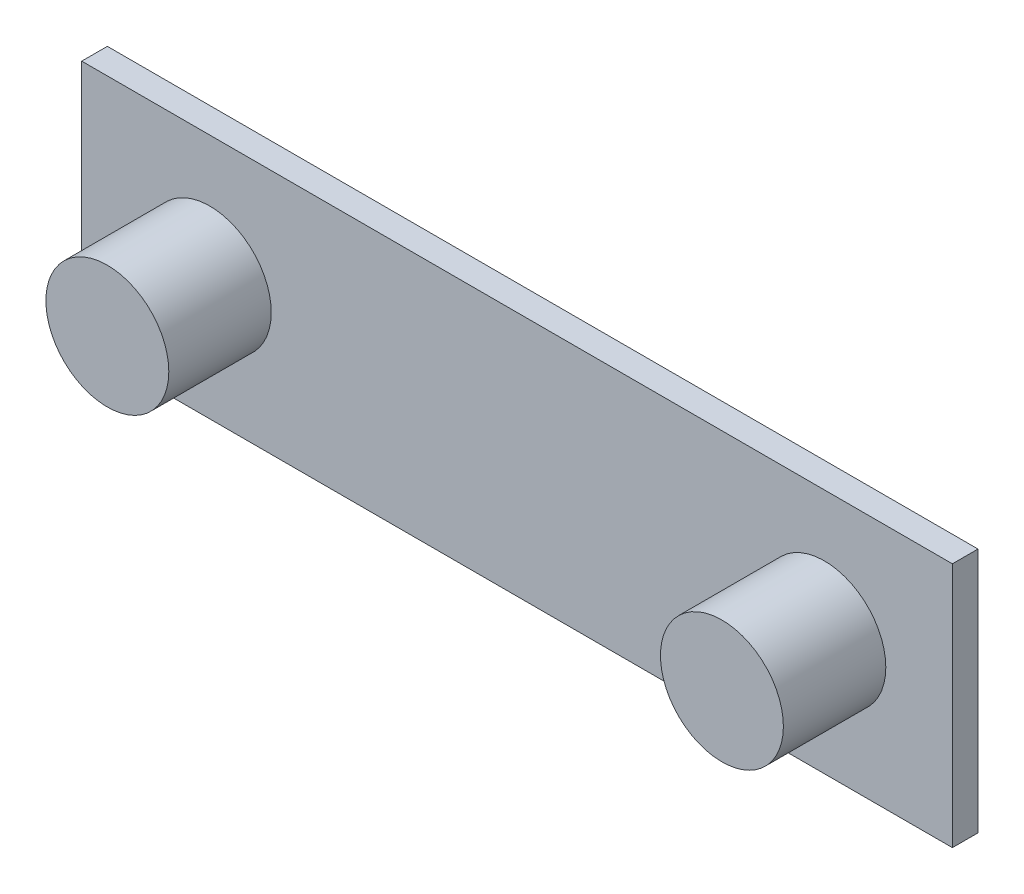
ISO-10303-21;
HEADER;
FILE_DESCRIPTION(('STEP AP214'),'2;1');
FILE_NAME('part.step','',(''),(''),'','','');
FILE_SCHEMA(('AUTOMOTIVE_DESIGN { 1 0 10303 214 1 1 1 1 }'));
ENDSEC;
DATA;
#1=APPLICATION_CONTEXT('core data for automotive mechanical design processes');
#2=APPLICATION_PROTOCOL_DEFINITION('international standard','automotive_design',2000,#1);
#3=PRODUCT_CONTEXT('',#1,'mechanical');
#4=PRODUCT('Part','Part','',(#3));
#5=PRODUCT_RELATED_PRODUCT_CATEGORY('part','',(#4));
#6=PRODUCT_DEFINITION_FORMATION('','',#4);
#7=PRODUCT_DEFINITION_CONTEXT('part definition',#1,'design');
#8=PRODUCT_DEFINITION('design','',#6,#7);
#9=PRODUCT_DEFINITION_SHAPE('','',#8);
#10=(LENGTH_UNIT() NAMED_UNIT(*) SI_UNIT(.MILLI.,.METRE.));
#11=(NAMED_UNIT(*) PLANE_ANGLE_UNIT() SI_UNIT($,.RADIAN.));
#12=(NAMED_UNIT(*) SI_UNIT($,.STERADIAN.) SOLID_ANGLE_UNIT());
#13=UNCERTAINTY_MEASURE_WITH_UNIT(LENGTH_MEASURE(1.E-05),#10,'distance_accuracy_value','');
#14=(GEOMETRIC_REPRESENTATION_CONTEXT(3) GLOBAL_UNCERTAINTY_ASSIGNED_CONTEXT((#13)) GLOBAL_UNIT_ASSIGNED_CONTEXT((#10,
#11,#12)) REPRESENTATION_CONTEXT('',''));
#15=CARTESIAN_POINT('',(0.,0.,0.));
#16=DIRECTION('',(0.,0.,1.));
#17=DIRECTION('',(1.,0.,0.));
#18=AXIS2_PLACEMENT_3D('',#15,#16,#17);
#19=CARTESIAN_POINT('',(0.,24.,2.5));
#20=DIRECTION('',(0.,1.,0.));
#21=DIRECTION('',(0.,0.,1.));
#22=AXIS2_PLACEMENT_3D('',#19,#20,#21);
#23=PLANE('',#22);
#24=DIRECTION('',(1.,0.,0.));
#25=VECTOR('',#24,1.);
#26=CARTESIAN_POINT('',(0.,24.,0.));
#27=LINE('',#26,#25);
#28=CARTESIAN_POINT('',(0.,24.,0.));
#29=VERTEX_POINT('',#28);
#30=CARTESIAN_POINT('',(85.,24.,0.));
#31=VERTEX_POINT('',#30);
#32=EDGE_CURVE('E116',#29,#31,#27,.T.);
#33=ORIENTED_EDGE('',*,*,#32,.F.);
#34=DIRECTION('',(0.,0.,-1.));
#35=VECTOR('',#34,1.);
#36=CARTESIAN_POINT('',(0.,24.,2.5));
#37=LINE('',#36,#35);
#38=CARTESIAN_POINT('',(0.,24.,2.5));
#39=VERTEX_POINT('',#38);
#40=EDGE_CURVE('E11',#39,#29,#37,.T.);
#41=ORIENTED_EDGE('',*,*,#40,.F.);
#42=DIRECTION('',(1.,0.,0.));
#43=VECTOR('',#42,1.);
#44=CARTESIAN_POINT('',(0.,24.,2.5));
#45=LINE('',#44,#43);
#46=CARTESIAN_POINT('',(85.,24.,2.5));
#47=VERTEX_POINT('',#46);
#48=EDGE_CURVE('E107',#39,#47,#45,.T.);
#49=ORIENTED_EDGE('',*,*,#48,.T.);
#50=DIRECTION('',(0.,0.,-1.));
#51=VECTOR('',#50,1.);
#52=CARTESIAN_POINT('',(85.,24.,2.5));
#53=LINE('',#52,#51);
#54=EDGE_CURVE('E48',#47,#31,#53,.T.);
#55=ORIENTED_EDGE('',*,*,#54,.T.);
#56=EDGE_LOOP('',(#33,#41,#49,#55));
#57=FACE_BOUND('',#56,.T.);
#58=ADVANCED_FACE('F45',(#57),#23,.T.);
#59=CARTESIAN_POINT('',(0.,0.,2.5));
#60=DIRECTION('',(-1.,0.,0.));
#61=DIRECTION('',(0.,0.,1.));
#62=AXIS2_PLACEMENT_3D('',#59,#60,#61);
#63=PLANE('',#62);
#64=DIRECTION('',(0.,1.,0.));
#65=VECTOR('',#64,1.);
#66=CARTESIAN_POINT('',(0.,0.,0.));
#67=LINE('',#66,#65);
#68=CARTESIAN_POINT('',(0.,0.,0.));
#69=VERTEX_POINT('',#68);
#70=EDGE_CURVE('E110',#69,#29,#67,.T.);
#71=ORIENTED_EDGE('',*,*,#70,.F.);
#72=DIRECTION('',(0.,0.,-1.));
#73=VECTOR('',#72,1.);
#74=CARTESIAN_POINT('',(0.,0.,2.5));
#75=LINE('',#74,#73);
#76=CARTESIAN_POINT('',(0.,0.,2.5));
#77=VERTEX_POINT('',#76);
#78=EDGE_CURVE('E55',#77,#69,#75,.T.);
#79=ORIENTED_EDGE('',*,*,#78,.F.);
#80=DIRECTION('',(0.,1.,0.));
#81=VECTOR('',#80,1.);
#82=CARTESIAN_POINT('',(0.,0.,2.5));
#83=LINE('',#82,#81);
#84=EDGE_CURVE('E94',#77,#39,#83,.T.);
#85=ORIENTED_EDGE('',*,*,#84,.T.);
#86=ORIENTED_EDGE('',*,*,#40,.T.);
#87=EDGE_LOOP('',(#71,#79,#85,#86));
#88=FACE_BOUND('',#87,.T.);
#89=ADVANCED_FACE('F133',(#88),#63,.T.);
#90=CARTESIAN_POINT('',(0.,0.,2.5));
#91=DIRECTION('',(0.,1.,0.));
#92=DIRECTION('',(0.,0.,1.));
#93=AXIS2_PLACEMENT_3D('',#90,#91,#92);
#94=PLANE('',#93);
#95=DIRECTION('',(1.,0.,0.));
#96=VECTOR('',#95,1.);
#97=CARTESIAN_POINT('',(0.,0.,0.));
#98=LINE('',#97,#96);
#99=CARTESIAN_POINT('',(85.,0.,0.));
#100=VERTEX_POINT('',#99);
#101=EDGE_CURVE('E100',#69,#100,#98,.T.);
#102=ORIENTED_EDGE('',*,*,#101,.T.);
#103=DIRECTION('',(0.,0.,-1.));
#104=VECTOR('',#103,1.);
#105=CARTESIAN_POINT('',(85.,0.,2.5));
#106=LINE('',#105,#104);
#107=CARTESIAN_POINT('',(85.,0.,2.5));
#108=VERTEX_POINT('',#107);
#109=EDGE_CURVE('E98',#108,#100,#106,.T.);
#110=ORIENTED_EDGE('',*,*,#109,.F.);
#111=DIRECTION('',(1.,0.,0.));
#112=VECTOR('',#111,1.);
#113=CARTESIAN_POINT('',(0.,0.,2.5));
#114=LINE('',#113,#112);
#115=EDGE_CURVE('E91',#77,#108,#114,.T.);
#116=ORIENTED_EDGE('',*,*,#115,.F.);
#117=ORIENTED_EDGE('',*,*,#78,.T.);
#118=EDGE_LOOP('',(#102,#110,#116,#117));
#119=FACE_BOUND('',#118,.T.);
#120=ADVANCED_FACE('F99',(#119),#94,.F.);
#121=CARTESIAN_POINT('',(85.,0.,2.5));
#122=DIRECTION('',(-1.,0.,0.));
#123=DIRECTION('',(0.,0.,1.));
#124=AXIS2_PLACEMENT_3D('',#121,#122,#123);
#125=PLANE('',#124);
#126=DIRECTION('',(0.,1.,0.));
#127=VECTOR('',#126,1.);
#128=CARTESIAN_POINT('',(85.,0.,0.));
#129=LINE('',#128,#127);
#130=EDGE_CURVE('E120',#100,#31,#129,.T.);
#131=ORIENTED_EDGE('',*,*,#130,.T.);
#132=ORIENTED_EDGE('',*,*,#54,.F.);
#133=DIRECTION('',(0.,1.,0.));
#134=VECTOR('',#133,1.);
#135=CARTESIAN_POINT('',(85.,0.,2.5));
#136=LINE('',#135,#134);
#137=EDGE_CURVE('E88',#108,#47,#136,.T.);
#138=ORIENTED_EDGE('',*,*,#137,.F.);
#139=ORIENTED_EDGE('',*,*,#109,.T.);
#140=EDGE_LOOP('',(#131,#132,#138,#139));
#141=FACE_BOUND('',#140,.T.);
#142=ADVANCED_FACE('F105',(#141),#125,.F.);
#143=CARTESIAN_POINT('',(0.,0.,2.5));
#144=DIRECTION('',(0.,0.,1.));
#145=DIRECTION('',(1.,0.,0.));
#146=AXIS2_PLACEMENT_3D('',#143,#144,#145);
#147=PLANE('',#146);
#148=CARTESIAN_POINT('',(12.5,12.,2.5));
#149=DIRECTION('',(0.,0.,1.));
#150=DIRECTION('',(1.,0.,0.));
#151=AXIS2_PLACEMENT_3D('',#148,#149,#150);
#152=CIRCLE('',#151,6.);
#153=CARTESIAN_POINT('',(18.5,12.,2.5));
#154=VERTEX_POINT('',#153);
#155=EDGE_CURVE('E174',#154,#154,#152,.T.);
#156=ORIENTED_EDGE('',*,*,#155,.F.);
#157=EDGE_LOOP('',(#156));
#158=FACE_BOUND('',#157,.T.);
#159=CARTESIAN_POINT('',(72.5,12.,2.5));
#160=DIRECTION('',(0.,0.,1.));
#161=DIRECTION('',(1.,0.,0.));
#162=AXIS2_PLACEMENT_3D('',#159,#160,#161);
#163=CIRCLE('',#162,6.);
#164=CARTESIAN_POINT('',(78.5,12.,2.5));
#165=VERTEX_POINT('',#164);
#166=EDGE_CURVE('E178',#165,#165,#163,.T.);
#167=ORIENTED_EDGE('',*,*,#166,.F.);
#168=EDGE_LOOP('',(#167));
#169=FACE_BOUND('',#168,.T.);
#170=ORIENTED_EDGE('',*,*,#48,.F.);
#171=ORIENTED_EDGE('',*,*,#84,.F.);
#172=ORIENTED_EDGE('',*,*,#115,.T.);
#173=ORIENTED_EDGE('',*,*,#137,.T.);
#174=EDGE_LOOP('',(#170,#171,#172,#173));
#175=FACE_BOUND('',#174,.T.);
#176=ADVANCED_FACE('F93',(#158,#169,#175),#147,.T.);
#177=CARTESIAN_POINT('',(0.,0.,0.));
#178=DIRECTION('',(0.,0.,1.));
#179=DIRECTION('',(1.,0.,0.));
#180=AXIS2_PLACEMENT_3D('',#177,#178,#179);
#181=PLANE('',#180);
#182=ORIENTED_EDGE('',*,*,#32,.T.);
#183=ORIENTED_EDGE('',*,*,#130,.F.);
#184=ORIENTED_EDGE('',*,*,#101,.F.);
#185=ORIENTED_EDGE('',*,*,#70,.T.);
#186=EDGE_LOOP('',(#182,#183,#184,#185));
#187=FACE_BOUND('',#186,.T.);
#188=ADVANCED_FACE('F132',(#187),#181,.F.);
#189=CARTESIAN_POINT('',(72.5,12.,12.5));
#190=DIRECTION('',(0.,0.,-1.));
#191=DIRECTION('',(-1.,0.,0.));
#192=AXIS2_PLACEMENT_3D('',#189,#190,#191);
#193=CYLINDRICAL_SURFACE('',#192,6.);
#194=CARTESIAN_POINT('',(72.5,12.,12.5));
#195=DIRECTION('',(0.,0.,1.));
#196=DIRECTION('',(1.,0.,0.));
#197=AXIS2_PLACEMENT_3D('',#194,#195,#196);
#198=CIRCLE('',#197,6.);
#199=CARTESIAN_POINT('',(78.5,12.,12.5));
#200=VERTEX_POINT('',#199);
#201=EDGE_CURVE('E183',#200,#200,#198,.T.);
#202=ORIENTED_EDGE('',*,*,#201,.F.);
#203=EDGE_LOOP('',(#202));
#204=FACE_BOUND('',#203,.T.);
#205=ORIENTED_EDGE('',*,*,#166,.T.);
#206=EDGE_LOOP('',(#205));
#207=FACE_BOUND('',#206,.T.);
#208=ADVANCED_FACE('F152',(#204,#207),#193,.T.);
#209=CARTESIAN_POINT('',(72.5,12.,12.5));
#210=DIRECTION('',(0.,0.,1.));
#211=DIRECTION('',(1.,0.,0.));
#212=AXIS2_PLACEMENT_3D('',#209,#210,#211);
#213=PLANE('',#212);
#214=ORIENTED_EDGE('',*,*,#201,.T.);
#215=EDGE_LOOP('',(#214));
#216=FACE_BOUND('',#215,.T.);
#217=ADVANCED_FACE('F156',(#216),#213,.T.);
#218=CARTESIAN_POINT('',(12.5,12.,12.5));
#219=DIRECTION('',(0.,0.,-1.));
#220=DIRECTION('',(-1.,0.,0.));
#221=AXIS2_PLACEMENT_3D('',#218,#219,#220);
#222=CYLINDRICAL_SURFACE('',#221,6.);
#223=CARTESIAN_POINT('',(12.5,12.,12.5));
#224=DIRECTION('',(0.,0.,1.));
#225=DIRECTION('',(1.,0.,0.));
#226=AXIS2_PLACEMENT_3D('',#223,#224,#225);
#227=CIRCLE('',#226,6.);
#228=CARTESIAN_POINT('',(18.5,12.,12.5));
#229=VERTEX_POINT('',#228);
#230=EDGE_CURVE('E121',#229,#229,#227,.T.);
#231=ORIENTED_EDGE('',*,*,#230,.F.);
#232=EDGE_LOOP('',(#231));
#233=FACE_BOUND('',#232,.T.);
#234=ORIENTED_EDGE('',*,*,#155,.T.);
#235=EDGE_LOOP('',(#234));
#236=FACE_BOUND('',#235,.T.);
#237=ADVANCED_FACE('F159',(#233,#236),#222,.T.);
#238=CARTESIAN_POINT('',(12.5,12.,12.5));
#239=DIRECTION('',(0.,0.,1.));
#240=DIRECTION('',(1.,0.,0.));
#241=AXIS2_PLACEMENT_3D('',#238,#239,#240);
#242=PLANE('',#241);
#243=ORIENTED_EDGE('',*,*,#230,.T.);
#244=EDGE_LOOP('',(#243));
#245=FACE_BOUND('',#244,.T.);
#246=ADVANCED_FACE('F165',(#245),#242,.T.);
#247=CLOSED_SHELL('',(#58,#89,#120,#142,#176,#188,#208,#217,#237,#246));
#248=MANIFOLD_SOLID_BREP('B2',#247);
#249=ADVANCED_BREP_SHAPE_REPRESENTATION('',(#18,#248),#14);
#250=SHAPE_DEFINITION_REPRESENTATION(#9,#249);
ENDSEC;
END-ISO-10303-21;
